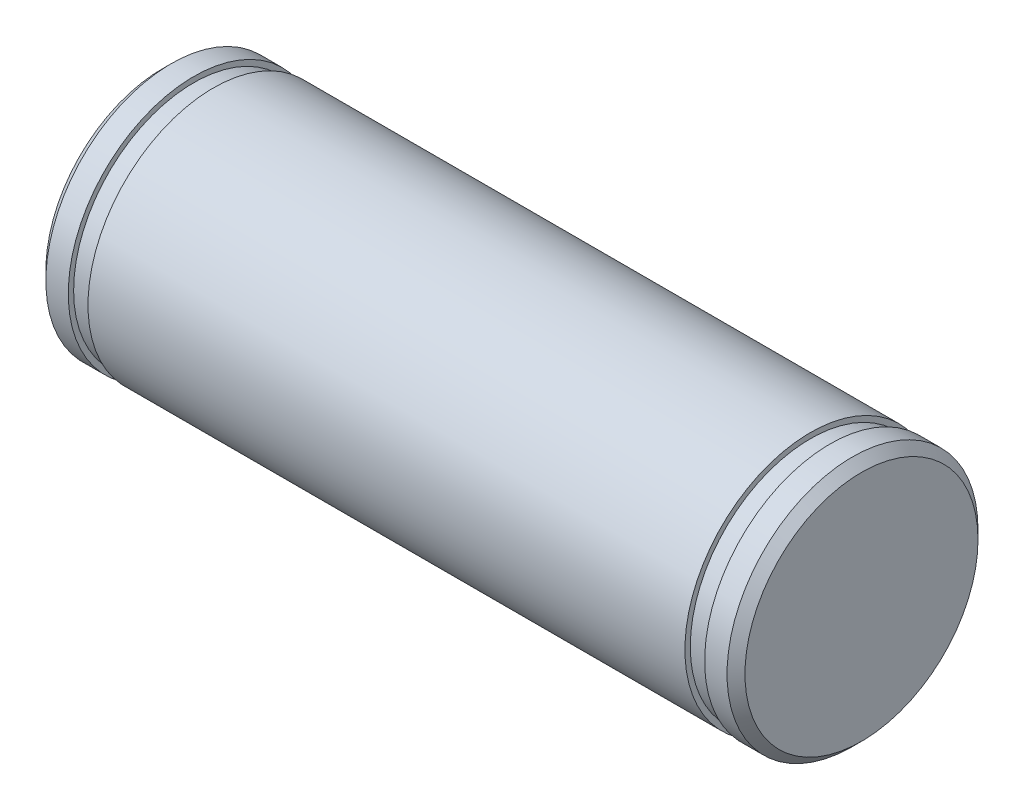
ISO-10303-21;
HEADER;
FILE_DESCRIPTION(('STEP AP214'),'2;1');
FILE_NAME('part.step','',(''),(''),'','','');
FILE_SCHEMA(('AUTOMOTIVE_DESIGN { 1 0 10303 214 1 1 1 1 }'));
ENDSEC;
DATA;
#1=APPLICATION_CONTEXT('core data for automotive mechanical design processes');
#2=APPLICATION_PROTOCOL_DEFINITION('international standard','automotive_design',2000,#1);
#3=PRODUCT_CONTEXT('',#1,'mechanical');
#4=PRODUCT('Part','Part','',(#3));
#5=PRODUCT_RELATED_PRODUCT_CATEGORY('part','',(#4));
#6=PRODUCT_DEFINITION_FORMATION('','',#4);
#7=PRODUCT_DEFINITION_CONTEXT('part definition',#1,'design');
#8=PRODUCT_DEFINITION('design','',#6,#7);
#9=PRODUCT_DEFINITION_SHAPE('','',#8);
#10=(LENGTH_UNIT() NAMED_UNIT(*) SI_UNIT(.MILLI.,.METRE.));
#11=(NAMED_UNIT(*) PLANE_ANGLE_UNIT() SI_UNIT($,.RADIAN.));
#12=(NAMED_UNIT(*) SI_UNIT($,.STERADIAN.) SOLID_ANGLE_UNIT());
#13=UNCERTAINTY_MEASURE_WITH_UNIT(LENGTH_MEASURE(1.E-05),#10,'distance_accuracy_value','');
#14=(GEOMETRIC_REPRESENTATION_CONTEXT(3) GLOBAL_UNCERTAINTY_ASSIGNED_CONTEXT((#13)) GLOBAL_UNIT_ASSIGNED_CONTEXT((#10,
#11,#12)) REPRESENTATION_CONTEXT('',''));
#15=CARTESIAN_POINT('',(0.,0.,0.));
#16=DIRECTION('',(0.,0.,1.));
#17=DIRECTION('',(1.,0.,0.));
#18=AXIS2_PLACEMENT_3D('',#15,#16,#17);
#19=CARTESIAN_POINT('',(0.,0.,0.));
#20=DIRECTION('',(-1.,0.,0.));
#21=DIRECTION('',(0.,0.,1.));
#22=AXIS2_PLACEMENT_3D('',#19,#20,#21);
#23=PLANE('',#22);
#24=CARTESIAN_POINT('',(0.,0.,0.));
#25=DIRECTION('',(1.,0.,0.));
#26=DIRECTION('',(0.,0.,-1.));
#27=AXIS2_PLACEMENT_3D('',#24,#25,#26);
#28=CIRCLE('',#27,6.5);
#29=CARTESIAN_POINT('',(0.,0.,-6.5));
#30=VERTEX_POINT('',#29);
#31=EDGE_CURVE('E12',#30,#30,#28,.T.);
#32=ORIENTED_EDGE('',*,*,#31,.F.);
#33=EDGE_LOOP('',(#32));
#34=FACE_BOUND('',#33,.T.);
#35=ADVANCED_FACE('F40',(#34),#23,.T.);
#36=CARTESIAN_POINT('',(0.5,0.,0.));
#37=DIRECTION('',(1.,0.,0.));
#38=DIRECTION('',(0.,0.,-1.));
#39=AXIS2_PLACEMENT_3D('',#36,#37,#38);
#40=CONICAL_SURFACE('',#39,6.99999999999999,0.785398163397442);
#41=ORIENTED_EDGE('',*,*,#31,.T.);
#42=EDGE_LOOP('',(#41));
#43=FACE_BOUND('',#42,.T.);
#44=CARTESIAN_POINT('',(0.5,0.,0.));
#45=DIRECTION('',(1.,0.,0.));
#46=DIRECTION('',(0.,0.,-1.));
#47=AXIS2_PLACEMENT_3D('',#44,#45,#46);
#48=CIRCLE('',#47,6.99999999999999);
#49=CARTESIAN_POINT('',(0.5,0.,-6.99999999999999));
#50=VERTEX_POINT('',#49);
#51=EDGE_CURVE('E46',#50,#50,#48,.T.);
#52=ORIENTED_EDGE('',*,*,#51,.F.);
#53=EDGE_LOOP('',(#52));
#54=FACE_BOUND('',#53,.T.);
#55=ADVANCED_FACE('F103',(#43,#54),#40,.T.);
#56=CARTESIAN_POINT('',(19.5,0.,0.));
#57=DIRECTION('',(1.,0.,0.));
#58=DIRECTION('',(0.,0.,-1.));
#59=AXIS2_PLACEMENT_3D('',#56,#57,#58);
#60=CYLINDRICAL_SURFACE('',#59,7.);
#61=ORIENTED_EDGE('',*,*,#51,.T.);
#62=EDGE_LOOP('',(#61));
#63=FACE_BOUND('',#62,.T.);
#64=CARTESIAN_POINT('',(1.75,0.,0.));
#65=DIRECTION('',(1.,0.,0.));
#66=DIRECTION('',(0.,0.,-1.));
#67=AXIS2_PLACEMENT_3D('',#64,#65,#66);
#68=CIRCLE('',#67,7.);
#69=CARTESIAN_POINT('',(1.75,0.,-7.));
#70=VERTEX_POINT('',#69);
#71=EDGE_CURVE('E50',#70,#70,#68,.T.);
#72=ORIENTED_EDGE('',*,*,#71,.F.);
#73=EDGE_LOOP('',(#72));
#74=FACE_BOUND('',#73,.T.);
#75=ADVANCED_FACE('F108',(#63,#74),#60,.T.);
#76=CARTESIAN_POINT('',(1.75,7.,0.));
#77=DIRECTION('',(1.,0.,0.));
#78=DIRECTION('',(0.,0.,-1.));
#79=AXIS2_PLACEMENT_3D('',#76,#77,#78);
#80=PLANE('',#79);
#81=ORIENTED_EDGE('',*,*,#71,.T.);
#82=EDGE_LOOP('',(#81));
#83=FACE_BOUND('',#82,.T.);
#84=CARTESIAN_POINT('',(1.75,0.,0.));
#85=DIRECTION('',(1.,0.,0.));
#86=DIRECTION('',(0.,0.,-1.));
#87=AXIS2_PLACEMENT_3D('',#84,#85,#86);
#88=CIRCLE('',#87,6.7);
#89=CARTESIAN_POINT('',(1.75,0.,-6.7));
#90=VERTEX_POINT('',#89);
#91=EDGE_CURVE('E54',#90,#90,#88,.T.);
#92=ORIENTED_EDGE('',*,*,#91,.F.);
#93=EDGE_LOOP('',(#92));
#94=FACE_BOUND('',#93,.T.);
#95=ADVANCED_FACE('F112',(#83,#94),#80,.T.);
#96=CARTESIAN_POINT('',(19.5,0.,0.));
#97=DIRECTION('',(1.,0.,0.));
#98=DIRECTION('',(0.,0.,-1.));
#99=AXIS2_PLACEMENT_3D('',#96,#97,#98);
#100=CYLINDRICAL_SURFACE('',#99,6.7);
#101=ORIENTED_EDGE('',*,*,#91,.T.);
#102=EDGE_LOOP('',(#101));
#103=FACE_BOUND('',#102,.T.);
#104=CARTESIAN_POINT('',(2.85,0.,0.));
#105=DIRECTION('',(1.,0.,0.));
#106=DIRECTION('',(0.,0.,-1.));
#107=AXIS2_PLACEMENT_3D('',#104,#105,#106);
#108=CIRCLE('',#107,6.7);
#109=CARTESIAN_POINT('',(2.85,0.,-6.7));
#110=VERTEX_POINT('',#109);
#111=EDGE_CURVE('E59',#110,#110,#108,.T.);
#112=ORIENTED_EDGE('',*,*,#111,.F.);
#113=EDGE_LOOP('',(#112));
#114=FACE_BOUND('',#113,.T.);
#115=ADVANCED_FACE('F99',(#103,#114),#100,.T.);
#116=CARTESIAN_POINT('',(2.85,6.7,0.));
#117=DIRECTION('',(-1.,0.,0.));
#118=DIRECTION('',(0.,0.,1.));
#119=AXIS2_PLACEMENT_3D('',#116,#117,#118);
#120=PLANE('',#119);
#121=ORIENTED_EDGE('',*,*,#111,.T.);
#122=EDGE_LOOP('',(#121));
#123=FACE_BOUND('',#122,.T.);
#124=CARTESIAN_POINT('',(2.85,0.,0.));
#125=DIRECTION('',(1.,0.,0.));
#126=DIRECTION('',(0.,0.,-1.));
#127=AXIS2_PLACEMENT_3D('',#124,#125,#126);
#128=CIRCLE('',#127,6.99999999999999);
#129=CARTESIAN_POINT('',(2.85,0.,-6.99999999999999));
#130=VERTEX_POINT('',#129);
#131=EDGE_CURVE('E62',#130,#130,#128,.T.);
#132=ORIENTED_EDGE('',*,*,#131,.F.);
#133=EDGE_LOOP('',(#132));
#134=FACE_BOUND('',#133,.T.);
#135=ADVANCED_FACE('F89',(#123,#134),#120,.T.);
#136=CARTESIAN_POINT('',(19.5,0.,0.));
#137=DIRECTION('',(1.,0.,0.));
#138=DIRECTION('',(0.,0.,-1.));
#139=AXIS2_PLACEMENT_3D('',#136,#137,#138);
#140=CYLINDRICAL_SURFACE('',#139,7.);
#141=ORIENTED_EDGE('',*,*,#131,.T.);
#142=EDGE_LOOP('',(#141));
#143=FACE_BOUND('',#142,.T.);
#144=CARTESIAN_POINT('',(36.15,0.,0.));
#145=DIRECTION('',(1.,0.,0.));
#146=DIRECTION('',(0.,0.,-1.));
#147=AXIS2_PLACEMENT_3D('',#144,#145,#146);
#148=CIRCLE('',#147,6.99999999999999);
#149=CARTESIAN_POINT('',(36.15,0.,-6.99999999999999));
#150=VERTEX_POINT('',#149);
#151=EDGE_CURVE('E80',#150,#150,#148,.T.);
#152=ORIENTED_EDGE('',*,*,#151,.F.);
#153=EDGE_LOOP('',(#152));
#154=FACE_BOUND('',#153,.T.);
#155=ADVANCED_FACE('F86',(#143,#154),#140,.T.);
#156=CARTESIAN_POINT('',(39.,0.,0.));
#157=DIRECTION('',(1.,0.,0.));
#158=DIRECTION('',(0.,0.,1.));
#159=AXIS2_PLACEMENT_3D('',#156,#157,#158);
#160=PLANE('',#159);
#161=CARTESIAN_POINT('',(39.,0.,0.));
#162=DIRECTION('',(1.,0.,0.));
#163=DIRECTION('',(0.,0.,-1.));
#164=AXIS2_PLACEMENT_3D('',#161,#162,#163);
#165=CIRCLE('',#164,6.5);
#166=CARTESIAN_POINT('',(39.,0.,-6.5));
#167=VERTEX_POINT('',#166);
#168=EDGE_CURVE('E65',#167,#167,#165,.T.);
#169=ORIENTED_EDGE('',*,*,#168,.T.);
#170=EDGE_LOOP('',(#169));
#171=FACE_BOUND('',#170,.T.);
#172=ADVANCED_FACE('F88',(#171),#160,.T.);
#173=CARTESIAN_POINT('',(38.5,0.,0.));
#174=DIRECTION('',(-1.,0.,0.));
#175=DIRECTION('',(0.,0.,-1.));
#176=AXIS2_PLACEMENT_3D('',#173,#174,#175);
#177=CONICAL_SURFACE('',#176,6.99999999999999,0.785398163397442);
#178=ORIENTED_EDGE('',*,*,#168,.F.);
#179=EDGE_LOOP('',(#178));
#180=FACE_BOUND('',#179,.T.);
#181=CARTESIAN_POINT('',(38.5,0.,0.));
#182=DIRECTION('',(1.,0.,0.));
#183=DIRECTION('',(0.,0.,-1.));
#184=AXIS2_PLACEMENT_3D('',#181,#182,#183);
#185=CIRCLE('',#184,6.99999999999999);
#186=CARTESIAN_POINT('',(38.5,0.,-6.99999999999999));
#187=VERTEX_POINT('',#186);
#188=EDGE_CURVE('E68',#187,#187,#185,.T.);
#189=ORIENTED_EDGE('',*,*,#188,.T.);
#190=EDGE_LOOP('',(#189));
#191=FACE_BOUND('',#190,.T.);
#192=ADVANCED_FACE('F96',(#180,#191),#177,.T.);
#193=CARTESIAN_POINT('',(19.5,0.,0.));
#194=DIRECTION('',(-1.,0.,0.));
#195=DIRECTION('',(0.,0.,-1.));
#196=AXIS2_PLACEMENT_3D('',#193,#194,#195);
#197=CYLINDRICAL_SURFACE('',#196,7.);
#198=ORIENTED_EDGE('',*,*,#188,.F.);
#199=EDGE_LOOP('',(#198));
#200=FACE_BOUND('',#199,.T.);
#201=CARTESIAN_POINT('',(37.25,0.,0.));
#202=DIRECTION('',(1.,0.,0.));
#203=DIRECTION('',(0.,0.,-1.));
#204=AXIS2_PLACEMENT_3D('',#201,#202,#203);
#205=CIRCLE('',#204,7.);
#206=CARTESIAN_POINT('',(37.25,0.,-7.));
#207=VERTEX_POINT('',#206);
#208=EDGE_CURVE('E71',#207,#207,#205,.T.);
#209=ORIENTED_EDGE('',*,*,#208,.T.);
#210=EDGE_LOOP('',(#209));
#211=FACE_BOUND('',#210,.T.);
#212=ADVANCED_FACE('F155',(#200,#211),#197,.T.);
#213=CARTESIAN_POINT('',(37.25,7.,0.));
#214=DIRECTION('',(-1.,0.,0.));
#215=DIRECTION('',(0.,0.,-1.));
#216=AXIS2_PLACEMENT_3D('',#213,#214,#215);
#217=PLANE('',#216);
#218=ORIENTED_EDGE('',*,*,#208,.F.);
#219=EDGE_LOOP('',(#218));
#220=FACE_BOUND('',#219,.T.);
#221=CARTESIAN_POINT('',(37.25,0.,0.));
#222=DIRECTION('',(1.,0.,0.));
#223=DIRECTION('',(0.,0.,-1.));
#224=AXIS2_PLACEMENT_3D('',#221,#222,#223);
#225=CIRCLE('',#224,6.7);
#226=CARTESIAN_POINT('',(37.25,0.,-6.7));
#227=VERTEX_POINT('',#226);
#228=EDGE_CURVE('E74',#227,#227,#225,.T.);
#229=ORIENTED_EDGE('',*,*,#228,.T.);
#230=EDGE_LOOP('',(#229));
#231=FACE_BOUND('',#230,.T.);
#232=ADVANCED_FACE('F165',(#220,#231),#217,.T.);
#233=CARTESIAN_POINT('',(19.5,0.,0.));
#234=DIRECTION('',(-1.,0.,0.));
#235=DIRECTION('',(0.,0.,-1.));
#236=AXIS2_PLACEMENT_3D('',#233,#234,#235);
#237=CYLINDRICAL_SURFACE('',#236,6.7);
#238=ORIENTED_EDGE('',*,*,#228,.F.);
#239=EDGE_LOOP('',(#238));
#240=FACE_BOUND('',#239,.T.);
#241=CARTESIAN_POINT('',(36.15,0.,0.));
#242=DIRECTION('',(1.,0.,0.));
#243=DIRECTION('',(0.,0.,-1.));
#244=AXIS2_PLACEMENT_3D('',#241,#242,#243);
#245=CIRCLE('',#244,6.7);
#246=CARTESIAN_POINT('',(36.15,0.,-6.7));
#247=VERTEX_POINT('',#246);
#248=EDGE_CURVE('E77',#247,#247,#245,.T.);
#249=ORIENTED_EDGE('',*,*,#248,.T.);
#250=EDGE_LOOP('',(#249));
#251=FACE_BOUND('',#250,.T.);
#252=ADVANCED_FACE('F175',(#240,#251),#237,.T.);
#253=CARTESIAN_POINT('',(36.15,6.7,0.));
#254=DIRECTION('',(1.,0.,0.));
#255=DIRECTION('',(0.,0.,1.));
#256=AXIS2_PLACEMENT_3D('',#253,#254,#255);
#257=PLANE('',#256);
#258=ORIENTED_EDGE('',*,*,#248,.F.);
#259=EDGE_LOOP('',(#258));
#260=FACE_BOUND('',#259,.T.);
#261=ORIENTED_EDGE('',*,*,#151,.T.);
#262=EDGE_LOOP('',(#261));
#263=FACE_BOUND('',#262,.T.);
#264=ADVANCED_FACE('F84',(#260,#263),#257,.T.);
#265=CLOSED_SHELL('',(#35,#55,#75,#95,#115,#135,#155,#172,#192,#212,#232,#252,#264));
#266=MANIFOLD_SOLID_BREP('B2',#265);
#267=ADVANCED_BREP_SHAPE_REPRESENTATION('',(#18,#266),#14);
#268=SHAPE_DEFINITION_REPRESENTATION(#9,#267);
ENDSEC;
END-ISO-10303-21;
